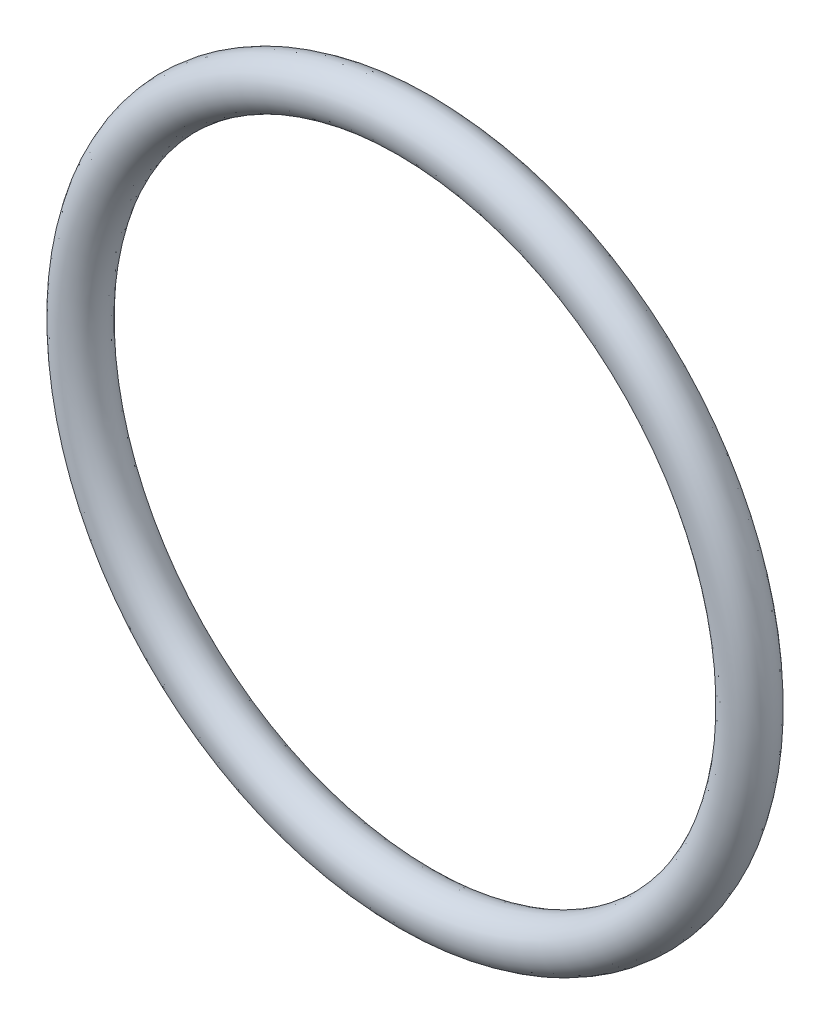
from build123d import *

# Parameters (mm, degrees)
ESQUISSE1_RX = 1.35
ESQUISSE1_RY = 1.31


with BuildPart() as part:
    # Esquisse1 → Base-R_volution (revolve)
    with BuildSketch(Plane(origin=(0, 0, 0), x_dir=(0, 0, -1), z_dir=(1, 0, 0))):
        with Locations(Location((1.31, 18.645), (0, 0, 90))):
            Ellipse(ESQUISSE1_RX, ESQUISSE1_RY)
    revolve(axis=Axis((0, 0, 0), (0, 0, -1)))


solid = part.part
